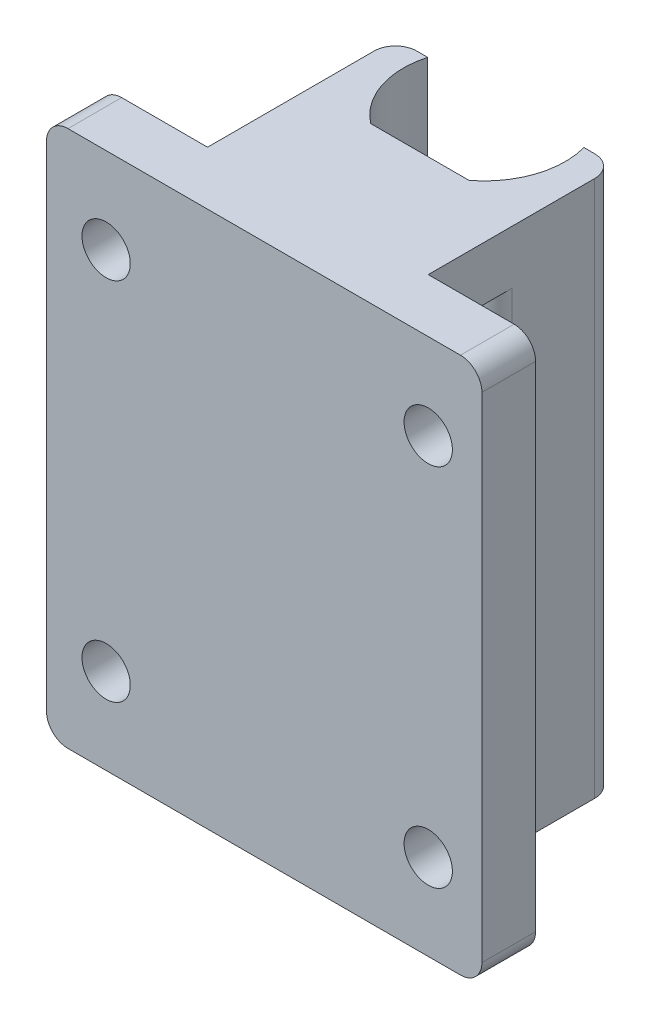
ISO-10303-21;
HEADER;
FILE_DESCRIPTION(('STEP AP214'),'2;1');
FILE_NAME('part.step','',(''),(''),'','','');
FILE_SCHEMA(('AUTOMOTIVE_DESIGN { 1 0 10303 214 1 1 1 1 }'));
ENDSEC;
DATA;
#1=APPLICATION_CONTEXT('core data for automotive mechanical design processes');
#2=APPLICATION_PROTOCOL_DEFINITION('international standard','automotive_design',2000,#1);
#3=PRODUCT_CONTEXT('',#1,'mechanical');
#4=PRODUCT('Part','Part','',(#3));
#5=PRODUCT_RELATED_PRODUCT_CATEGORY('part','',(#4));
#6=PRODUCT_DEFINITION_FORMATION('','',#4);
#7=PRODUCT_DEFINITION_CONTEXT('part definition',#1,'design');
#8=PRODUCT_DEFINITION('design','',#6,#7);
#9=PRODUCT_DEFINITION_SHAPE('','',#8);
#10=(LENGTH_UNIT() NAMED_UNIT(*) SI_UNIT(.MILLI.,.METRE.));
#11=(NAMED_UNIT(*) PLANE_ANGLE_UNIT() SI_UNIT($,.RADIAN.));
#12=(NAMED_UNIT(*) SI_UNIT($,.STERADIAN.) SOLID_ANGLE_UNIT());
#13=UNCERTAINTY_MEASURE_WITH_UNIT(LENGTH_MEASURE(1.E-05),#10,'distance_accuracy_value','');
#14=(GEOMETRIC_REPRESENTATION_CONTEXT(3) GLOBAL_UNCERTAINTY_ASSIGNED_CONTEXT((#13)) GLOBAL_UNIT_ASSIGNED_CONTEXT((#10,
#11,#12)) REPRESENTATION_CONTEXT('',''));
#15=CARTESIAN_POINT('',(0.,0.,0.));
#16=DIRECTION('',(0.,0.,1.));
#17=DIRECTION('',(1.,0.,0.));
#18=AXIS2_PLACEMENT_3D('',#15,#16,#17);
#19=CARTESIAN_POINT('',(15.,50.,-20.5));
#20=DIRECTION('',(0.,-1.,0.));
#21=DIRECTION('',(0.,0.,-1.));
#22=AXIS2_PLACEMENT_3D('',#19,#20,#21);
#23=CYLINDRICAL_SURFACE('',#22,7.54680019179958);
#24=DIRECTION('',(0.,-1.,0.));
#25=VECTOR('',#24,1.);
#26=CARTESIAN_POINT('',(10.422424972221,50.,-14.5));
#27=LINE('',#26,#25);
#28=CARTESIAN_POINT('',(10.422424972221,0.,-14.5));
#29=VERTEX_POINT('',#28);
#30=CARTESIAN_POINT('',(10.422424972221,2.5,-14.5));
#31=VERTEX_POINT('',#30);
#32=EDGE_CURVE('E336',#29,#31,#27,.F.);
#33=ORIENTED_EDGE('',*,*,#32,.F.);
#34=CARTESIAN_POINT('',(15.,0.,-20.5));
#35=DIRECTION('',(0.,-1.,0.));
#36=DIRECTION('',(0.,0.,-1.));
#37=AXIS2_PLACEMENT_3D('',#34,#35,#36);
#38=CIRCLE('',#37,7.54680019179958);
#39=CARTESIAN_POINT('',(7.72303681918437,0.,-22.5));
#40=VERTEX_POINT('',#39);
#41=EDGE_CURVE('E383',#29,#40,#38,.T.);
#42=ORIENTED_EDGE('',*,*,#41,.T.);
#43=DIRECTION('',(0.,-1.,0.));
#44=VECTOR('',#43,1.);
#45=CARTESIAN_POINT('',(7.72303681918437,50.,-22.5));
#46=LINE('',#45,#44);
#47=CARTESIAN_POINT('',(7.72303681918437,50.,-22.5));
#48=VERTEX_POINT('',#47);
#49=EDGE_CURVE('E398',#48,#40,#46,.T.);
#50=ORIENTED_EDGE('',*,*,#49,.F.);
#51=CARTESIAN_POINT('',(15.,50.,-20.5));
#52=DIRECTION('',(0.,-1.,0.));
#53=DIRECTION('',(0.,0.,-1.));
#54=AXIS2_PLACEMENT_3D('',#51,#52,#53);
#55=CIRCLE('',#54,7.54680019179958);
#56=CARTESIAN_POINT('',(10.422424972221,50.,-14.5));
#57=VERTEX_POINT('',#56);
#58=EDGE_CURVE('E361',#57,#48,#55,.T.);
#59=ORIENTED_EDGE('',*,*,#58,.F.);
#60=DIRECTION('',(0.,-1.,0.));
#61=VECTOR('',#60,1.);
#62=CARTESIAN_POINT('',(10.422424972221,50.,-14.5));
#63=LINE('',#62,#61);
#64=CARTESIAN_POINT('',(10.422424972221,47.5,-14.5));
#65=VERTEX_POINT('',#64);
#66=EDGE_CURVE('E343',#57,#65,#63,.T.);
#67=ORIENTED_EDGE('',*,*,#66,.T.);
#68=CARTESIAN_POINT('',(15.,47.5,-20.5));
#69=DIRECTION('',(0.,-1.,0.));
#70=DIRECTION('',(0.,0.,-1.));
#71=AXIS2_PLACEMENT_3D('',#68,#69,#70);
#72=CIRCLE('',#71,7.54680019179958);
#73=CARTESIAN_POINT('',(19.577575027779,47.5,-14.5));
#74=VERTEX_POINT('',#73);
#75=EDGE_CURVE('E416',#65,#74,#72,.F.);
#76=ORIENTED_EDGE('',*,*,#75,.T.);
#77=DIRECTION('',(0.,-1.,0.));
#78=VECTOR('',#77,1.);
#79=CARTESIAN_POINT('',(19.577575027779,50.,-14.5));
#80=LINE('',#79,#78);
#81=CARTESIAN_POINT('',(19.577575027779,50.,-14.5));
#82=VERTEX_POINT('',#81);
#83=EDGE_CURVE('E346',#74,#82,#80,.F.);
#84=ORIENTED_EDGE('',*,*,#83,.T.);
#85=CARTESIAN_POINT('',(22.2769631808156,50.,-22.5));
#86=VERTEX_POINT('',#85);
#87=EDGE_CURVE('E362',#86,#82,#55,.T.);
#88=ORIENTED_EDGE('',*,*,#87,.F.);
#89=DIRECTION('',(0.,-1.,0.));
#90=VECTOR('',#89,1.);
#91=CARTESIAN_POINT('',(22.2769631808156,50.,-22.5));
#92=LINE('',#91,#90);
#93=CARTESIAN_POINT('',(22.2769631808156,0.,-22.5));
#94=VERTEX_POINT('',#93);
#95=EDGE_CURVE('E401',#86,#94,#92,.T.);
#96=ORIENTED_EDGE('',*,*,#95,.T.);
#97=CARTESIAN_POINT('',(19.577575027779,0.,-14.5));
#98=VERTEX_POINT('',#97);
#99=EDGE_CURVE('E384',#94,#98,#38,.T.);
#100=ORIENTED_EDGE('',*,*,#99,.T.);
#101=DIRECTION('',(0.,-1.,0.));
#102=VECTOR('',#101,1.);
#103=CARTESIAN_POINT('',(19.577575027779,50.,-14.5));
#104=LINE('',#103,#102);
#105=CARTESIAN_POINT('',(19.577575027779,2.5,-14.5));
#106=VERTEX_POINT('',#105);
#107=EDGE_CURVE('E333',#106,#98,#104,.T.);
#108=ORIENTED_EDGE('',*,*,#107,.F.);
#109=CARTESIAN_POINT('',(15.,2.5,-20.5));
#110=DIRECTION('',(0.,1.,0.));
#111=DIRECTION('',(-1.,0.,0.));
#112=AXIS2_PLACEMENT_3D('',#109,#110,#111);
#113=CIRCLE('',#112,7.54680019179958);
#114=EDGE_CURVE('E419',#106,#31,#113,.F.);
#115=ORIENTED_EDGE('',*,*,#114,.T.);
#116=EDGE_LOOP('',(#33,#42,#50,#59,#67,#76,#84,#88,#96,#100,#108,#115));
#117=FACE_BOUND('',#116,.T.);
#118=ADVANCED_FACE('F33',(#117),#23,.F.);
#119=CARTESIAN_POINT('',(-5.27696318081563,50.,0.));
#120=DIRECTION('',(1.,0.,0.));
#121=DIRECTION('',(0.,0.,-1.));
#122=AXIS2_PLACEMENT_3D('',#119,#120,#121);
#123=PLANE('',#122);
#124=DIRECTION('',(0.,-1.,0.));
#125=VECTOR('',#124,1.);
#126=CARTESIAN_POINT('',(-5.27696318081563,50.,0.));
#127=LINE('',#126,#125);
#128=CARTESIAN_POINT('',(-5.27696318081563,48.,0.));
#129=VERTEX_POINT('',#128);
#130=CARTESIAN_POINT('',(-5.27696318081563,2.,0.));
#131=VERTEX_POINT('',#130);
#132=EDGE_CURVE('E413',#129,#131,#127,.T.);
#133=ORIENTED_EDGE('',*,*,#132,.F.);
#134=DIRECTION('',(0.,0.,1.));
#135=VECTOR('',#134,1.);
#136=CARTESIAN_POINT('',(-5.27696318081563,48.,0.));
#137=LINE('',#136,#135);
#138=CARTESIAN_POINT('',(-5.27696318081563,48.,-5.));
#139=VERTEX_POINT('',#138);
#140=EDGE_CURVE('E442',#129,#139,#137,.F.);
#141=ORIENTED_EDGE('',*,*,#140,.T.);
#142=DIRECTION('',(0.,-1.,0.));
#143=VECTOR('',#142,1.);
#144=CARTESIAN_POINT('',(-5.27696318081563,50.,-5.));
#145=LINE('',#144,#143);
#146=CARTESIAN_POINT('',(-5.27696318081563,2.,-5.));
#147=VERTEX_POINT('',#146);
#148=EDGE_CURVE('E373',#139,#147,#145,.T.);
#149=ORIENTED_EDGE('',*,*,#148,.T.);
#150=DIRECTION('',(0.,0.,1.));
#151=VECTOR('',#150,1.);
#152=CARTESIAN_POINT('',(-5.27696318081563,2.,0.));
#153=LINE('',#152,#151);
#154=EDGE_CURVE('E439',#147,#131,#153,.T.);
#155=ORIENTED_EDGE('',*,*,#154,.T.);
#156=EDGE_LOOP('',(#133,#141,#149,#155));
#157=FACE_BOUND('',#156,.T.);
#158=ADVANCED_FACE('F588',(#157),#123,.F.);
#159=CARTESIAN_POINT('',(-5.27696318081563,50.,0.));
#160=DIRECTION('',(0.,0.,-1.));
#161=DIRECTION('',(-1.,0.,0.));
#162=AXIS2_PLACEMENT_3D('',#159,#160,#161);
#163=PLANE('',#162);
#164=CARTESIAN_POINT('',(30.2769631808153,8.,0.));
#165=DIRECTION('',(0.,0.,-1.));
#166=DIRECTION('',(-1.,0.,0.));
#167=AXIS2_PLACEMENT_3D('',#164,#165,#166);
#168=CIRCLE('',#167,2.25);
#169=CARTESIAN_POINT('',(28.0269631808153,8.,0.));
#170=VERTEX_POINT('',#169);
#171=EDGE_CURVE('E304',#170,#170,#168,.T.);
#172=ORIENTED_EDGE('',*,*,#171,.T.);
#173=EDGE_LOOP('',(#172));
#174=FACE_BOUND('',#173,.T.);
#175=CARTESIAN_POINT('',(0.276963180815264,8.,0.));
#176=DIRECTION('',(0.,0.,-1.));
#177=DIRECTION('',(-1.,0.,0.));
#178=AXIS2_PLACEMENT_3D('',#175,#176,#177);
#179=CIRCLE('',#178,2.25);
#180=CARTESIAN_POINT('',(-1.97303681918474,8.,0.));
#181=VERTEX_POINT('',#180);
#182=EDGE_CURVE('E310',#181,#181,#179,.T.);
#183=ORIENTED_EDGE('',*,*,#182,.T.);
#184=EDGE_LOOP('',(#183));
#185=FACE_BOUND('',#184,.T.);
#186=CARTESIAN_POINT('',(0.276963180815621,42.,0.));
#187=DIRECTION('',(0.,0.,-1.));
#188=DIRECTION('',(-1.,0.,0.));
#189=AXIS2_PLACEMENT_3D('',#186,#187,#188);
#190=CIRCLE('',#189,2.25);
#191=CARTESIAN_POINT('',(-1.97303681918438,42.,0.));
#192=VERTEX_POINT('',#191);
#193=EDGE_CURVE('E316',#192,#192,#190,.T.);
#194=ORIENTED_EDGE('',*,*,#193,.T.);
#195=EDGE_LOOP('',(#194));
#196=FACE_BOUND('',#195,.T.);
#197=CARTESIAN_POINT('',(30.2769631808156,42.,0.));
#198=DIRECTION('',(0.,0.,-1.));
#199=DIRECTION('',(-1.,0.,0.));
#200=AXIS2_PLACEMENT_3D('',#197,#198,#199);
#201=CIRCLE('',#200,2.25);
#202=CARTESIAN_POINT('',(28.0269631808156,42.,0.));
#203=VERTEX_POINT('',#202);
#204=EDGE_CURVE('E322',#203,#203,#201,.T.);
#205=ORIENTED_EDGE('',*,*,#204,.T.);
#206=EDGE_LOOP('',(#205));
#207=FACE_BOUND('',#206,.T.);
#208=DIRECTION('',(1.,0.,0.));
#209=VECTOR('',#208,1.);
#210=CARTESIAN_POINT('',(-5.27696318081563,50.,0.));
#211=LINE('',#210,#209);
#212=CARTESIAN_POINT('',(-3.27696318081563,50.,0.));
#213=VERTEX_POINT('',#212);
#214=CARTESIAN_POINT('',(33.2769631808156,50.,0.));
#215=VERTEX_POINT('',#214);
#216=EDGE_CURVE('E350',#213,#215,#211,.T.);
#217=ORIENTED_EDGE('',*,*,#216,.F.);
#218=CARTESIAN_POINT('',(-3.27696318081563,48.,0.));
#219=DIRECTION('',(0.,0.,-1.));
#220=DIRECTION('',(-1.,0.,0.));
#221=AXIS2_PLACEMENT_3D('',#218,#219,#220);
#222=CIRCLE('',#221,2.);
#223=EDGE_CURVE('E437',#213,#129,#222,.F.);
#224=ORIENTED_EDGE('',*,*,#223,.T.);
#225=ORIENTED_EDGE('',*,*,#132,.T.);
#226=CARTESIAN_POINT('',(-3.27696318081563,2.,0.));
#227=DIRECTION('',(0.,0.,-1.));
#228=DIRECTION('',(-1.,0.,0.));
#229=AXIS2_PLACEMENT_3D('',#226,#227,#228);
#230=CIRCLE('',#229,2.);
#231=CARTESIAN_POINT('',(-3.27696318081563,0.,0.));
#232=VERTEX_POINT('',#231);
#233=EDGE_CURVE('E435',#131,#232,#230,.F.);
#234=ORIENTED_EDGE('',*,*,#233,.T.);
#235=DIRECTION('',(1.,0.,0.));
#236=VECTOR('',#235,1.);
#237=CARTESIAN_POINT('',(-5.27696318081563,0.,0.));
#238=LINE('',#237,#236);
#239=CARTESIAN_POINT('',(33.2769631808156,0.,0.));
#240=VERTEX_POINT('',#239);
#241=EDGE_CURVE('E349',#232,#240,#238,.T.);
#242=ORIENTED_EDGE('',*,*,#241,.T.);
#243=CARTESIAN_POINT('',(33.2769631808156,2.,0.));
#244=DIRECTION('',(0.,0.,-1.));
#245=DIRECTION('',(-1.,0.,0.));
#246=AXIS2_PLACEMENT_3D('',#243,#244,#245);
#247=CIRCLE('',#246,2.);
#248=CARTESIAN_POINT('',(35.2769631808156,2.,0.));
#249=VERTEX_POINT('',#248);
#250=EDGE_CURVE('E431',#240,#249,#247,.F.);
#251=ORIENTED_EDGE('',*,*,#250,.T.);
#252=DIRECTION('',(0.,-1.,0.));
#253=VECTOR('',#252,1.);
#254=CARTESIAN_POINT('',(35.2769631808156,50.,0.));
#255=LINE('',#254,#253);
#256=CARTESIAN_POINT('',(35.2769631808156,48.,0.));
#257=VERTEX_POINT('',#256);
#258=EDGE_CURVE('E410',#257,#249,#255,.T.);
#259=ORIENTED_EDGE('',*,*,#258,.F.);
#260=CARTESIAN_POINT('',(33.2769631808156,48.,0.));
#261=DIRECTION('',(0.,0.,-1.));
#262=DIRECTION('',(-1.,0.,0.));
#263=AXIS2_PLACEMENT_3D('',#260,#261,#262);
#264=CIRCLE('',#263,2.);
#265=EDGE_CURVE('E433',#257,#215,#264,.F.);
#266=ORIENTED_EDGE('',*,*,#265,.T.);
#267=EDGE_LOOP('',(#217,#224,#225,#234,#242,#251,#259,#266));
#268=FACE_BOUND('',#267,.T.);
#269=ADVANCED_FACE('F592',(#174,#185,#196,#207,#268),#163,.F.);
#270=CARTESIAN_POINT('',(35.2769631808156,50.,0.));
#271=DIRECTION('',(-1.,0.,0.));
#272=DIRECTION('',(0.,0.,1.));
#273=AXIS2_PLACEMENT_3D('',#270,#271,#272);
#274=PLANE('',#273);
#275=DIRECTION('',(0.,-1.,0.));
#276=VECTOR('',#275,1.);
#277=CARTESIAN_POINT('',(35.2769631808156,50.,-5.00000000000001));
#278=LINE('',#277,#276);
#279=CARTESIAN_POINT('',(35.2769631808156,48.,-5.00000000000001));
#280=VERTEX_POINT('',#279);
#281=CARTESIAN_POINT('',(35.2769631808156,2.,-5.00000000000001));
#282=VERTEX_POINT('',#281);
#283=EDGE_CURVE('E407',#280,#282,#278,.T.);
#284=ORIENTED_EDGE('',*,*,#283,.F.);
#285=DIRECTION('',(0.,0.,-1.));
#286=VECTOR('',#285,1.);
#287=CARTESIAN_POINT('',(35.2769631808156,48.,0.));
#288=LINE('',#287,#286);
#289=EDGE_CURVE('E463',#280,#257,#288,.F.);
#290=ORIENTED_EDGE('',*,*,#289,.T.);
#291=ORIENTED_EDGE('',*,*,#258,.T.);
#292=DIRECTION('',(0.,0.,-1.));
#293=VECTOR('',#292,1.);
#294=CARTESIAN_POINT('',(35.2769631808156,2.,-5.00000000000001));
#295=LINE('',#294,#293);
#296=EDGE_CURVE('E460',#249,#282,#295,.T.);
#297=ORIENTED_EDGE('',*,*,#296,.T.);
#298=EDGE_LOOP('',(#284,#290,#291,#297));
#299=FACE_BOUND('',#298,.T.);
#300=ADVANCED_FACE('F606',(#299),#274,.F.);
#301=CARTESIAN_POINT('',(25.2769631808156,50.,-5.));
#302=DIRECTION('',(0.,0.,1.));
#303=DIRECTION('',(1.,0.,0.));
#304=AXIS2_PLACEMENT_3D('',#301,#302,#303);
#305=PLANE('',#304);
#306=CARTESIAN_POINT('',(30.2769631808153,8.,-5.00000000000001));
#307=DIRECTION('',(0.,0.,-1.));
#308=DIRECTION('',(-1.,0.,0.));
#309=AXIS2_PLACEMENT_3D('',#306,#307,#308);
#310=CIRCLE('',#309,2.25);
#311=CARTESIAN_POINT('',(28.0269631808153,8.,-5.));
#312=VERTEX_POINT('',#311);
#313=EDGE_CURVE('E303',#312,#312,#310,.T.);
#314=ORIENTED_EDGE('',*,*,#313,.F.);
#315=EDGE_LOOP('',(#314));
#316=FACE_BOUND('',#315,.T.);
#317=CARTESIAN_POINT('',(30.2769631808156,42.,-5.00000000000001));
#318=DIRECTION('',(0.,0.,-1.));
#319=DIRECTION('',(-1.,0.,0.));
#320=AXIS2_PLACEMENT_3D('',#317,#318,#319);
#321=CIRCLE('',#320,2.25);
#322=CARTESIAN_POINT('',(28.0269631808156,42.,-5.));
#323=VERTEX_POINT('',#322);
#324=EDGE_CURVE('E319',#323,#323,#321,.T.);
#325=ORIENTED_EDGE('',*,*,#324,.F.);
#326=EDGE_LOOP('',(#325));
#327=FACE_BOUND('',#326,.T.);
#328=DIRECTION('',(-1.,0.,0.));
#329=VECTOR('',#328,1.);
#330=CARTESIAN_POINT('',(25.2769631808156,50.,-5.));
#331=LINE('',#330,#329);
#332=CARTESIAN_POINT('',(33.2769631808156,50.,-5.00000000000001));
#333=VERTEX_POINT('',#332);
#334=CARTESIAN_POINT('',(25.2769631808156,50.,-5.));
#335=VERTEX_POINT('',#334);
#336=EDGE_CURVE('E353',#333,#335,#331,.T.);
#337=ORIENTED_EDGE('',*,*,#336,.F.);
#338=CARTESIAN_POINT('',(33.2769631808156,48.,-5.00000000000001));
#339=DIRECTION('',(0.,0.,1.));
#340=DIRECTION('',(1.,0.,0.));
#341=AXIS2_PLACEMENT_3D('',#338,#339,#340);
#342=CIRCLE('',#341,2.);
#343=EDGE_CURVE('E458',#333,#280,#342,.F.);
#344=ORIENTED_EDGE('',*,*,#343,.T.);
#345=ORIENTED_EDGE('',*,*,#283,.T.);
#346=CARTESIAN_POINT('',(33.2769631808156,2.,-5.00000000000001));
#347=DIRECTION('',(0.,0.,1.));
#348=DIRECTION('',(1.,0.,0.));
#349=AXIS2_PLACEMENT_3D('',#346,#347,#348);
#350=CIRCLE('',#349,2.);
#351=CARTESIAN_POINT('',(33.2769631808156,0.,-5.00000000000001));
#352=VERTEX_POINT('',#351);
#353=EDGE_CURVE('E456',#282,#352,#350,.F.);
#354=ORIENTED_EDGE('',*,*,#353,.T.);
#355=DIRECTION('',(-1.,0.,0.));
#356=VECTOR('',#355,1.);
#357=CARTESIAN_POINT('',(25.2769631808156,0.,-5.));
#358=LINE('',#357,#356);
#359=CARTESIAN_POINT('',(25.2769631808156,0.,-5.));
#360=VERTEX_POINT('',#359);
#361=EDGE_CURVE('E376',#352,#360,#358,.T.);
#362=ORIENTED_EDGE('',*,*,#361,.T.);
#363=DIRECTION('',(0.,-1.,0.));
#364=VECTOR('',#363,1.);
#365=CARTESIAN_POINT('',(25.2769631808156,50.,-5.));
#366=LINE('',#365,#364);
#367=EDGE_CURVE('E404',#335,#360,#366,.T.);
#368=ORIENTED_EDGE('',*,*,#367,.F.);
#369=EDGE_LOOP('',(#337,#344,#345,#354,#362,#368));
#370=FACE_BOUND('',#369,.T.);
#371=ADVANCED_FACE('F536',(#316,#327,#370),#305,.F.);
#372=CARTESIAN_POINT('',(25.2769631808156,50.,-22.5));
#373=DIRECTION('',(-1.,0.,0.));
#374=DIRECTION('',(0.,0.,1.));
#375=AXIS2_PLACEMENT_3D('',#372,#373,#374);
#376=PLANE('',#375);
#377=DIRECTION('',(0.,-1.,0.));
#378=VECTOR('',#377,1.);
#379=CARTESIAN_POINT('',(25.2769631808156,50.,-12.8026940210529));
#380=LINE('',#379,#378);
#381=CARTESIAN_POINT('',(25.2769631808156,10.,-12.8026940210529));
#382=VERTEX_POINT('',#381);
#383=CARTESIAN_POINT('',(25.2769631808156,5.,-12.8026940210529));
#384=VERTEX_POINT('',#383);
#385=EDGE_CURVE('E493',#382,#384,#380,.T.);
#386=ORIENTED_EDGE('',*,*,#385,.T.);
#387=DIRECTION('',(0.,0.,1.));
#388=VECTOR('',#387,1.);
#389=CARTESIAN_POINT('',(25.2769631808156,5.,-22.5));
#390=LINE('',#389,#388);
#391=CARTESIAN_POINT('',(25.2769631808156,5.,-8.80269402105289));
#392=VERTEX_POINT('',#391);
#393=EDGE_CURVE('E48',#384,#392,#390,.T.);
#394=ORIENTED_EDGE('',*,*,#393,.T.);
#395=DIRECTION('',(0.,1.,0.));
#396=VECTOR('',#395,1.);
#397=CARTESIAN_POINT('',(25.2769631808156,50.,-8.80269402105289));
#398=LINE('',#397,#396);
#399=CARTESIAN_POINT('',(25.2769631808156,10.,-8.80269402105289));
#400=VERTEX_POINT('',#399);
#401=EDGE_CURVE('E250',#392,#400,#398,.T.);
#402=ORIENTED_EDGE('',*,*,#401,.T.);
#403=DIRECTION('',(0.,0.,-1.));
#404=VECTOR('',#403,1.);
#405=CARTESIAN_POINT('',(25.2769631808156,10.,-22.5));
#406=LINE('',#405,#404);
#407=EDGE_CURVE('E56',#400,#382,#406,.T.);
#408=ORIENTED_EDGE('',*,*,#407,.T.);
#409=EDGE_LOOP('',(#386,#394,#402,#408));
#410=FACE_BOUND('',#409,.T.);
#411=DIRECTION('',(0.,-1.,0.));
#412=VECTOR('',#411,1.);
#413=CARTESIAN_POINT('',(25.2769631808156,50.,-12.8026940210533));
#414=LINE('',#413,#412);
#415=CARTESIAN_POINT('',(25.2769631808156,45.,-12.8026940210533));
#416=VERTEX_POINT('',#415);
#417=CARTESIAN_POINT('',(25.2769631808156,40.,-12.8026940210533));
#418=VERTEX_POINT('',#417);
#419=EDGE_CURVE('E490',#416,#418,#414,.T.);
#420=ORIENTED_EDGE('',*,*,#419,.T.);
#421=DIRECTION('',(0.,0.,1.));
#422=VECTOR('',#421,1.);
#423=CARTESIAN_POINT('',(25.2769631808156,40.,-22.5));
#424=LINE('',#423,#422);
#425=CARTESIAN_POINT('',(25.2769631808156,40.,-8.80269402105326));
#426=VERTEX_POINT('',#425);
#427=EDGE_CURVE('E289',#418,#426,#424,.T.);
#428=ORIENTED_EDGE('',*,*,#427,.T.);
#429=DIRECTION('',(0.,1.,0.));
#430=VECTOR('',#429,1.);
#431=CARTESIAN_POINT('',(25.2769631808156,50.,-8.80269402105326));
#432=LINE('',#431,#430);
#433=CARTESIAN_POINT('',(25.2769631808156,45.,-8.80269402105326));
#434=VERTEX_POINT('',#433);
#435=EDGE_CURVE('E298',#426,#434,#432,.T.);
#436=ORIENTED_EDGE('',*,*,#435,.T.);
#437=DIRECTION('',(0.,0.,-1.));
#438=VECTOR('',#437,1.);
#439=CARTESIAN_POINT('',(25.2769631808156,45.,-22.5));
#440=LINE('',#439,#438);
#441=EDGE_CURVE('E301',#434,#416,#440,.T.);
#442=ORIENTED_EDGE('',*,*,#441,.T.);
#443=EDGE_LOOP('',(#420,#428,#436,#442));
#444=FACE_BOUND('',#443,.T.);
#445=DIRECTION('',(0.,0.,-1.));
#446=VECTOR('',#445,1.);
#447=CARTESIAN_POINT('',(25.2769631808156,0.,-22.5));
#448=LINE('',#447,#446);
#449=CARTESIAN_POINT('',(25.2769631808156,0.,-20.5));
#450=VERTEX_POINT('',#449);
#451=EDGE_CURVE('E378',#360,#450,#448,.T.);
#452=ORIENTED_EDGE('',*,*,#451,.T.);
#453=DIRECTION('',(0.,-1.,0.));
#454=VECTOR('',#453,1.);
#455=CARTESIAN_POINT('',(25.2769631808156,50.,-20.5));
#456=LINE('',#455,#454);
#457=CARTESIAN_POINT('',(25.2769631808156,50.,-20.5));
#458=VERTEX_POINT('',#457);
#459=EDGE_CURVE('E473',#450,#458,#456,.F.);
#460=ORIENTED_EDGE('',*,*,#459,.T.);
#461=DIRECTION('',(0.,0.,-1.));
#462=VECTOR('',#461,1.);
#463=CARTESIAN_POINT('',(25.2769631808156,50.,-22.5));
#464=LINE('',#463,#462);
#465=EDGE_CURVE('E356',#335,#458,#464,.T.);
#466=ORIENTED_EDGE('',*,*,#465,.F.);
#467=ORIENTED_EDGE('',*,*,#367,.T.);
#468=EDGE_LOOP('',(#452,#460,#466,#467));
#469=FACE_BOUND('',#468,.T.);
#470=ADVANCED_FACE('F532',(#410,#444,#469),#376,.F.);
#471=CARTESIAN_POINT('',(22.2769631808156,50.,-22.5));
#472=DIRECTION('',(0.,0.,1.));
#473=DIRECTION('',(1.,0.,0.));
#474=AXIS2_PLACEMENT_3D('',#471,#472,#473);
#475=PLANE('',#474);
#476=DIRECTION('',(-1.,0.,0.));
#477=VECTOR('',#476,1.);
#478=CARTESIAN_POINT('',(22.2769631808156,50.,-22.5));
#479=LINE('',#478,#477);
#480=CARTESIAN_POINT('',(23.2769631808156,50.,-22.5));
#481=VERTEX_POINT('',#480);
#482=EDGE_CURVE('E359',#481,#86,#479,.T.);
#483=ORIENTED_EDGE('',*,*,#482,.F.);
#484=DIRECTION('',(0.,-1.,0.));
#485=VECTOR('',#484,1.);
#486=CARTESIAN_POINT('',(23.2769631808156,50.,-22.5));
#487=LINE('',#486,#485);
#488=CARTESIAN_POINT('',(23.2769631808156,0.,-22.5));
#489=VERTEX_POINT('',#488);
#490=EDGE_CURVE('E470',#481,#489,#487,.T.);
#491=ORIENTED_EDGE('',*,*,#490,.T.);
#492=DIRECTION('',(-1.,0.,0.));
#493=VECTOR('',#492,1.);
#494=CARTESIAN_POINT('',(22.2769631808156,0.,-22.5));
#495=LINE('',#494,#493);
#496=EDGE_CURVE('E381',#489,#94,#495,.T.);
#497=ORIENTED_EDGE('',*,*,#496,.T.);
#498=ORIENTED_EDGE('',*,*,#95,.F.);
#499=EDGE_LOOP('',(#483,#491,#497,#498));
#500=FACE_BOUND('',#499,.T.);
#501=ADVANCED_FACE('F535',(#500),#475,.F.);
#502=CARTESIAN_POINT('',(7.72303681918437,50.,-22.5));
#503=DIRECTION('',(0.,0.,1.));
#504=DIRECTION('',(1.,0.,0.));
#505=AXIS2_PLACEMENT_3D('',#502,#503,#504);
#506=PLANE('',#505);
#507=DIRECTION('',(-1.,0.,0.));
#508=VECTOR('',#507,1.);
#509=CARTESIAN_POINT('',(7.72303681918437,0.,-22.5));
#510=LINE('',#509,#508);
#511=CARTESIAN_POINT('',(6.72303681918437,0.,-22.5));
#512=VERTEX_POINT('',#511);
#513=EDGE_CURVE('E386',#40,#512,#510,.T.);
#514=ORIENTED_EDGE('',*,*,#513,.T.);
#515=DIRECTION('',(0.,-1.,0.));
#516=VECTOR('',#515,1.);
#517=CARTESIAN_POINT('',(6.72303681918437,50.,-22.5));
#518=LINE('',#517,#516);
#519=CARTESIAN_POINT('',(6.72303681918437,50.,-22.5));
#520=VERTEX_POINT('',#519);
#521=EDGE_CURVE('E468',#512,#520,#518,.F.);
#522=ORIENTED_EDGE('',*,*,#521,.T.);
#523=DIRECTION('',(-1.,0.,0.));
#524=VECTOR('',#523,1.);
#525=CARTESIAN_POINT('',(7.72303681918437,50.,-22.5));
#526=LINE('',#525,#524);
#527=EDGE_CURVE('E365',#48,#520,#526,.T.);
#528=ORIENTED_EDGE('',*,*,#527,.F.);
#529=ORIENTED_EDGE('',*,*,#49,.T.);
#530=EDGE_LOOP('',(#514,#522,#528,#529));
#531=FACE_BOUND('',#530,.T.);
#532=ADVANCED_FACE('F565',(#531),#506,.F.);
#533=CARTESIAN_POINT('',(4.72303681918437,50.,-22.5));
#534=DIRECTION('',(1.,0.,0.));
#535=DIRECTION('',(0.,0.,-1.));
#536=AXIS2_PLACEMENT_3D('',#533,#534,#535);
#537=PLANE('',#536);
#538=DIRECTION('',(0.,0.,1.));
#539=VECTOR('',#538,1.);
#540=CARTESIAN_POINT('',(4.72303681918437,5.,-10.8026940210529));
#541=LINE('',#540,#539);
#542=CARTESIAN_POINT('',(4.72303681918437,5.,-12.8026940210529));
#543=VERTEX_POINT('',#542);
#544=CARTESIAN_POINT('',(4.72303681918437,5.,-8.80269402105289));
#545=VERTEX_POINT('',#544);
#546=EDGE_CURVE('E255',#543,#545,#541,.T.);
#547=ORIENTED_EDGE('',*,*,#546,.F.);
#548=DIRECTION('',(0.,-1.,0.));
#549=VECTOR('',#548,1.);
#550=CARTESIAN_POINT('',(4.72303681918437,50.,-12.8026940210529));
#551=LINE('',#550,#549);
#552=CARTESIAN_POINT('',(4.72303681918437,10.,-12.8026940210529));
#553=VERTEX_POINT('',#552);
#554=EDGE_CURVE('E480',#543,#553,#551,.F.);
#555=ORIENTED_EDGE('',*,*,#554,.T.);
#556=DIRECTION('',(0.,0.,-1.));
#557=VECTOR('',#556,1.);
#558=CARTESIAN_POINT('',(4.72303681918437,10.,-10.8026940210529));
#559=LINE('',#558,#557);
#560=CARTESIAN_POINT('',(4.72303681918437,10.,-8.80269402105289));
#561=VERTEX_POINT('',#560);
#562=EDGE_CURVE('E265',#561,#553,#559,.T.);
#563=ORIENTED_EDGE('',*,*,#562,.F.);
#564=DIRECTION('',(0.,1.,0.));
#565=VECTOR('',#564,1.);
#566=CARTESIAN_POINT('',(4.72303681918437,10.,-8.80269402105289));
#567=LINE('',#566,#565);
#568=EDGE_CURVE('E248',#545,#561,#567,.T.);
#569=ORIENTED_EDGE('',*,*,#568,.F.);
#570=EDGE_LOOP('',(#547,#555,#563,#569));
#571=FACE_BOUND('',#570,.T.);
#572=DIRECTION('',(0.,0.,1.));
#573=VECTOR('',#572,1.);
#574=CARTESIAN_POINT('',(4.72303681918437,40.,-10.8026940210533));
#575=LINE('',#574,#573);
#576=CARTESIAN_POINT('',(4.72303681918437,40.,-12.8026940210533));
#577=VERTEX_POINT('',#576);
#578=CARTESIAN_POINT('',(4.72303681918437,40.,-8.80269402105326));
#579=VERTEX_POINT('',#578);
#580=EDGE_CURVE('E277',#577,#579,#575,.T.);
#581=ORIENTED_EDGE('',*,*,#580,.F.);
#582=DIRECTION('',(0.,-1.,0.));
#583=VECTOR('',#582,1.);
#584=CARTESIAN_POINT('',(4.72303681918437,50.,-12.8026940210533));
#585=LINE('',#584,#583);
#586=CARTESIAN_POINT('',(4.72303681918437,45.,-12.8026940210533));
#587=VERTEX_POINT('',#586);
#588=EDGE_CURVE('E482',#577,#587,#585,.F.);
#589=ORIENTED_EDGE('',*,*,#588,.T.);
#590=DIRECTION('',(0.,0.,-1.));
#591=VECTOR('',#590,1.);
#592=CARTESIAN_POINT('',(4.72303681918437,45.,-10.8026940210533));
#593=LINE('',#592,#591);
#594=CARTESIAN_POINT('',(4.72303681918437,45.,-8.80269402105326));
#595=VERTEX_POINT('',#594);
#596=EDGE_CURVE('E283',#595,#587,#593,.T.);
#597=ORIENTED_EDGE('',*,*,#596,.F.);
#598=DIRECTION('',(0.,1.,0.));
#599=VECTOR('',#598,1.);
#600=CARTESIAN_POINT('',(4.72303681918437,45.,-8.80269402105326));
#601=LINE('',#600,#599);
#602=EDGE_CURVE('E280',#579,#595,#601,.T.);
#603=ORIENTED_EDGE('',*,*,#602,.F.);
#604=EDGE_LOOP('',(#581,#589,#597,#603));
#605=FACE_BOUND('',#604,.T.);
#606=DIRECTION('',(0.,0.,1.));
#607=VECTOR('',#606,1.);
#608=CARTESIAN_POINT('',(4.72303681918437,50.,-22.5));
#609=LINE('',#608,#607);
#610=CARTESIAN_POINT('',(4.72303681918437,50.,-20.5));
#611=VERTEX_POINT('',#610);
#612=CARTESIAN_POINT('',(4.72303681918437,50.,-5.));
#613=VERTEX_POINT('',#612);
#614=EDGE_CURVE('E368',#611,#613,#609,.T.);
#615=ORIENTED_EDGE('',*,*,#614,.F.);
#616=DIRECTION('',(0.,-1.,0.));
#617=VECTOR('',#616,1.);
#618=CARTESIAN_POINT('',(4.72303681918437,50.,-20.5));
#619=LINE('',#618,#617);
#620=CARTESIAN_POINT('',(4.72303681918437,0.,-20.5));
#621=VERTEX_POINT('',#620);
#622=EDGE_CURVE('E465',#611,#621,#619,.T.);
#623=ORIENTED_EDGE('',*,*,#622,.T.);
#624=DIRECTION('',(0.,0.,1.));
#625=VECTOR('',#624,1.);
#626=CARTESIAN_POINT('',(4.72303681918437,0.,-22.5));
#627=LINE('',#626,#625);
#628=CARTESIAN_POINT('',(4.72303681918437,0.,-5.));
#629=VERTEX_POINT('',#628);
#630=EDGE_CURVE('E389',#621,#629,#627,.T.);
#631=ORIENTED_EDGE('',*,*,#630,.T.);
#632=DIRECTION('',(0.,-1.,0.));
#633=VECTOR('',#632,1.);
#634=CARTESIAN_POINT('',(4.72303681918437,50.,-5.));
#635=LINE('',#634,#633);
#636=EDGE_CURVE('E395',#613,#629,#635,.T.);
#637=ORIENTED_EDGE('',*,*,#636,.F.);
#638=EDGE_LOOP('',(#615,#623,#631,#637));
#639=FACE_BOUND('',#638,.T.);
#640=ADVANCED_FACE('F263',(#571,#605,#639),#537,.F.);
#641=CARTESIAN_POINT('',(4.72303681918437,50.,-5.));
#642=DIRECTION('',(0.,0.,1.));
#643=DIRECTION('',(1.,0.,0.));
#644=AXIS2_PLACEMENT_3D('',#641,#642,#643);
#645=PLANE('',#644);
#646=CARTESIAN_POINT('',(0.276963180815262,8.,-4.99999999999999));
#647=DIRECTION('',(0.,0.,-1.));
#648=DIRECTION('',(-1.,0.,0.));
#649=AXIS2_PLACEMENT_3D('',#646,#647,#648);
#650=CIRCLE('',#649,2.25);
#651=CARTESIAN_POINT('',(-1.97303681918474,8.,-4.99999999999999));
#652=VERTEX_POINT('',#651);
#653=EDGE_CURVE('E307',#652,#652,#650,.T.);
#654=ORIENTED_EDGE('',*,*,#653,.F.);
#655=EDGE_LOOP('',(#654));
#656=FACE_BOUND('',#655,.T.);
#657=CARTESIAN_POINT('',(0.276963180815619,42.,-4.99999999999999));
#658=DIRECTION('',(0.,0.,-1.));
#659=DIRECTION('',(-1.,0.,0.));
#660=AXIS2_PLACEMENT_3D('',#657,#658,#659);
#661=CIRCLE('',#660,2.25);
#662=CARTESIAN_POINT('',(-1.97303681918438,42.,-4.99999999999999));
#663=VERTEX_POINT('',#662);
#664=EDGE_CURVE('E313',#663,#663,#661,.T.);
#665=ORIENTED_EDGE('',*,*,#664,.F.);
#666=EDGE_LOOP('',(#665));
#667=FACE_BOUND('',#666,.T.);
#668=ORIENTED_EDGE('',*,*,#148,.F.);
#669=CARTESIAN_POINT('',(-3.27696318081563,48.,-5.));
#670=DIRECTION('',(0.,0.,1.));
#671=DIRECTION('',(1.,0.,0.));
#672=AXIS2_PLACEMENT_3D('',#669,#670,#671);
#673=CIRCLE('',#672,2.);
#674=CARTESIAN_POINT('',(-3.27696318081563,50.,-5.));
#675=VERTEX_POINT('',#674);
#676=EDGE_CURVE('E446',#139,#675,#673,.F.);
#677=ORIENTED_EDGE('',*,*,#676,.T.);
#678=DIRECTION('',(-1.,0.,0.));
#679=VECTOR('',#678,1.);
#680=CARTESIAN_POINT('',(4.72303681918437,50.,-5.));
#681=LINE('',#680,#679);
#682=EDGE_CURVE('E370',#613,#675,#681,.T.);
#683=ORIENTED_EDGE('',*,*,#682,.F.);
#684=ORIENTED_EDGE('',*,*,#636,.T.);
#685=DIRECTION('',(-1.,0.,0.));
#686=VECTOR('',#685,1.);
#687=CARTESIAN_POINT('',(4.72303681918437,0.,-5.));
#688=LINE('',#687,#686);
#689=CARTESIAN_POINT('',(-3.27696318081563,0.,-5.));
#690=VERTEX_POINT('',#689);
#691=EDGE_CURVE('E354',#629,#690,#688,.T.);
#692=ORIENTED_EDGE('',*,*,#691,.T.);
#693=CARTESIAN_POINT('',(-3.27696318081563,2.,-5.));
#694=DIRECTION('',(0.,0.,1.));
#695=DIRECTION('',(1.,0.,0.));
#696=AXIS2_PLACEMENT_3D('',#693,#694,#695);
#697=CIRCLE('',#696,2.);
#698=EDGE_CURVE('E444',#690,#147,#697,.F.);
#699=ORIENTED_EDGE('',*,*,#698,.T.);
#700=EDGE_LOOP('',(#668,#677,#683,#684,#692,#699));
#701=FACE_BOUND('',#700,.T.);
#702=ADVANCED_FACE('F581',(#656,#667,#701),#645,.F.);
#703=CARTESIAN_POINT('',(15.,50.,-20.5));
#704=DIRECTION('',(0.,-1.,0.));
#705=DIRECTION('',(0.,0.,-1.));
#706=AXIS2_PLACEMENT_3D('',#703,#704,#705);
#707=PLANE('',#706);
#708=ORIENTED_EDGE('',*,*,#682,.T.);
#709=DIRECTION('',(0.,0.,1.));
#710=VECTOR('',#709,1.);
#711=CARTESIAN_POINT('',(-3.27696318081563,50.,-20.5));
#712=LINE('',#711,#710);
#713=EDGE_CURVE('E428',#675,#213,#712,.T.);
#714=ORIENTED_EDGE('',*,*,#713,.T.);
#715=ORIENTED_EDGE('',*,*,#216,.T.);
#716=DIRECTION('',(0.,0.,-1.));
#717=VECTOR('',#716,1.);
#718=CARTESIAN_POINT('',(33.2769631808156,50.,-20.5));
#719=LINE('',#718,#717);
#720=EDGE_CURVE('E425',#215,#333,#719,.T.);
#721=ORIENTED_EDGE('',*,*,#720,.T.);
#722=ORIENTED_EDGE('',*,*,#336,.T.);
#723=ORIENTED_EDGE('',*,*,#465,.T.);
#724=CARTESIAN_POINT('',(23.2769631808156,50.,-20.5));
#725=DIRECTION('',(0.,-1.,0.));
#726=DIRECTION('',(0.,0.,-1.));
#727=AXIS2_PLACEMENT_3D('',#724,#725,#726);
#728=CIRCLE('',#727,2.);
#729=EDGE_CURVE('E421',#458,#481,#728,.F.);
#730=ORIENTED_EDGE('',*,*,#729,.T.);
#731=ORIENTED_EDGE('',*,*,#482,.T.);
#732=ORIENTED_EDGE('',*,*,#87,.T.);
#733=DIRECTION('',(1.,0.,0.));
#734=VECTOR('',#733,1.);
#735=CARTESIAN_POINT('',(22.2769631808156,50.,-14.5));
#736=LINE('',#735,#734);
#737=EDGE_CURVE('E341',#57,#82,#736,.T.);
#738=ORIENTED_EDGE('',*,*,#737,.F.);
#739=ORIENTED_EDGE('',*,*,#58,.T.);
#740=ORIENTED_EDGE('',*,*,#527,.T.);
#741=CARTESIAN_POINT('',(6.72303681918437,50.,-20.5));
#742=DIRECTION('',(0.,-1.,0.));
#743=DIRECTION('',(0.,0.,-1.));
#744=AXIS2_PLACEMENT_3D('',#741,#742,#743);
#745=CIRCLE('',#744,2.);
#746=EDGE_CURVE('E423',#520,#611,#745,.F.);
#747=ORIENTED_EDGE('',*,*,#746,.T.);
#748=ORIENTED_EDGE('',*,*,#614,.T.);
#749=EDGE_LOOP('',(#708,#714,#715,#721,#722,#723,#730,#731,#732,#738,#739,#740,#747,#748));
#750=FACE_BOUND('',#749,.T.);
#751=ADVANCED_FACE('F550',(#750),#707,.F.);
#752=CARTESIAN_POINT('',(15.,0.,-20.5));
#753=DIRECTION('',(0.,-1.,0.));
#754=DIRECTION('',(0.,0.,-1.));
#755=AXIS2_PLACEMENT_3D('',#752,#753,#754);
#756=PLANE('',#755);
#757=ORIENTED_EDGE('',*,*,#241,.F.);
#758=DIRECTION('',(0.,0.,1.));
#759=VECTOR('',#758,1.);
#760=CARTESIAN_POINT('',(-3.27696318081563,0.,-5.));
#761=LINE('',#760,#759);
#762=EDGE_CURVE('E454',#232,#690,#761,.F.);
#763=ORIENTED_EDGE('',*,*,#762,.T.);
#764=ORIENTED_EDGE('',*,*,#691,.F.);
#765=ORIENTED_EDGE('',*,*,#630,.F.);
#766=CARTESIAN_POINT('',(6.72303681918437,0.,-20.5));
#767=DIRECTION('',(0.,-1.,0.));
#768=DIRECTION('',(0.,0.,-1.));
#769=AXIS2_PLACEMENT_3D('',#766,#767,#768);
#770=CIRCLE('',#769,2.);
#771=EDGE_CURVE('E450',#621,#512,#770,.T.);
#772=ORIENTED_EDGE('',*,*,#771,.T.);
#773=ORIENTED_EDGE('',*,*,#513,.F.);
#774=ORIENTED_EDGE('',*,*,#41,.F.);
#775=DIRECTION('',(-1.,0.,0.));
#776=VECTOR('',#775,1.);
#777=CARTESIAN_POINT('',(22.2769631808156,0.,-14.5));
#778=LINE('',#777,#776);
#779=EDGE_CURVE('E325',#98,#29,#778,.T.);
#780=ORIENTED_EDGE('',*,*,#779,.F.);
#781=ORIENTED_EDGE('',*,*,#99,.F.);
#782=ORIENTED_EDGE('',*,*,#496,.F.);
#783=CARTESIAN_POINT('',(23.2769631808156,0.,-20.5));
#784=DIRECTION('',(0.,-1.,0.));
#785=DIRECTION('',(0.,0.,-1.));
#786=AXIS2_PLACEMENT_3D('',#783,#784,#785);
#787=CIRCLE('',#786,2.);
#788=EDGE_CURVE('E448',#489,#450,#787,.T.);
#789=ORIENTED_EDGE('',*,*,#788,.T.);
#790=ORIENTED_EDGE('',*,*,#451,.F.);
#791=ORIENTED_EDGE('',*,*,#361,.F.);
#792=DIRECTION('',(0.,0.,-1.));
#793=VECTOR('',#792,1.);
#794=CARTESIAN_POINT('',(33.2769631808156,0.,0.));
#795=LINE('',#794,#793);
#796=EDGE_CURVE('E452',#352,#240,#795,.F.);
#797=ORIENTED_EDGE('',*,*,#796,.T.);
#798=EDGE_LOOP('',(#757,#763,#764,#765,#772,#773,#774,#780,#781,#782,#789,#790,#791,#797));
#799=FACE_BOUND('',#798,.T.);
#800=ADVANCED_FACE('F576',(#799),#756,.T.);
#801=CARTESIAN_POINT('',(22.2769631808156,47.5,-4.5));
#802=DIRECTION('',(0.,-1.,0.));
#803=DIRECTION('',(0.,0.,-1.));
#804=AXIS2_PLACEMENT_3D('',#801,#802,#803);
#805=PLANE('',#804);
#806=ORIENTED_EDGE('',*,*,#75,.F.);
#807=DIRECTION('',(-1.,0.,0.));
#808=VECTOR('',#807,1.);
#809=CARTESIAN_POINT('',(22.2769631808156,47.5,-14.5));
#810=LINE('',#809,#808);
#811=EDGE_CURVE('E339',#74,#65,#810,.T.);
#812=ORIENTED_EDGE('',*,*,#811,.F.);
#813=EDGE_LOOP('',(#806,#812));
#814=FACE_BOUND('',#813,.T.);
#815=ADVANCED_FACE('F875',(#814),#805,.T.);
#816=CARTESIAN_POINT('',(0.,0.,-14.5));
#817=DIRECTION('',(0.,0.,-1.));
#818=DIRECTION('',(-1.,0.,0.));
#819=AXIS2_PLACEMENT_3D('',#816,#817,#818);
#820=PLANE('',#819);
#821=ORIENTED_EDGE('',*,*,#83,.F.);
#822=ORIENTED_EDGE('',*,*,#811,.T.);
#823=ORIENTED_EDGE('',*,*,#66,.F.);
#824=ORIENTED_EDGE('',*,*,#737,.T.);
#825=EDGE_LOOP('',(#821,#822,#823,#824));
#826=FACE_BOUND('',#825,.T.);
#827=ADVANCED_FACE('F871',(#826),#820,.T.);
#828=CARTESIAN_POINT('',(22.2769631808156,2.5,-4.5));
#829=DIRECTION('',(0.,1.,0.));
#830=DIRECTION('',(-1.,0.,0.));
#831=AXIS2_PLACEMENT_3D('',#828,#829,#830);
#832=PLANE('',#831);
#833=ORIENTED_EDGE('',*,*,#114,.F.);
#834=DIRECTION('',(1.,0.,0.));
#835=VECTOR('',#834,1.);
#836=CARTESIAN_POINT('',(22.2769631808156,2.5,-14.5));
#837=LINE('',#836,#835);
#838=EDGE_CURVE('E330',#31,#106,#837,.T.);
#839=ORIENTED_EDGE('',*,*,#838,.F.);
#840=EDGE_LOOP('',(#833,#839));
#841=FACE_BOUND('',#840,.T.);
#842=ADVANCED_FACE('F867',(#841),#832,.T.);
#843=CARTESIAN_POINT('',(0.,0.,-14.5));
#844=DIRECTION('',(0.,0.,1.));
#845=DIRECTION('',(1.,0.,0.));
#846=AXIS2_PLACEMENT_3D('',#843,#844,#845);
#847=PLANE('',#846);
#848=ORIENTED_EDGE('',*,*,#779,.T.);
#849=ORIENTED_EDGE('',*,*,#32,.T.);
#850=ORIENTED_EDGE('',*,*,#838,.T.);
#851=ORIENTED_EDGE('',*,*,#107,.T.);
#852=EDGE_LOOP('',(#848,#849,#850,#851));
#853=FACE_BOUND('',#852,.T.);
#854=ADVANCED_FACE('F642',(#853),#847,.F.);
#855=CARTESIAN_POINT('',(-3.27696318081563,48.,-20.5));
#856=DIRECTION('',(0.,0.,1.));
#857=DIRECTION('',(1.,0.,0.));
#858=AXIS2_PLACEMENT_3D('',#855,#856,#857);
#859=CYLINDRICAL_SURFACE('',#858,2.);
#860=ORIENTED_EDGE('',*,*,#676,.F.);
#861=ORIENTED_EDGE('',*,*,#140,.F.);
#862=ORIENTED_EDGE('',*,*,#223,.F.);
#863=ORIENTED_EDGE('',*,*,#713,.F.);
#864=EDGE_LOOP('',(#860,#861,#862,#863));
#865=FACE_BOUND('',#864,.T.);
#866=ADVANCED_FACE('F596',(#865),#859,.T.);
#867=CARTESIAN_POINT('',(-3.27696318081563,2.,0.));
#868=DIRECTION('',(0.,0.,-1.));
#869=DIRECTION('',(-1.,0.,0.));
#870=AXIS2_PLACEMENT_3D('',#867,#868,#869);
#871=CYLINDRICAL_SURFACE('',#870,2.);
#872=ORIENTED_EDGE('',*,*,#698,.F.);
#873=ORIENTED_EDGE('',*,*,#762,.F.);
#874=ORIENTED_EDGE('',*,*,#233,.F.);
#875=ORIENTED_EDGE('',*,*,#154,.F.);
#876=EDGE_LOOP('',(#872,#873,#874,#875));
#877=FACE_BOUND('',#876,.T.);
#878=ADVANCED_FACE('F585',(#877),#871,.T.);
#879=CARTESIAN_POINT('',(33.2769631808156,48.,-20.5));
#880=DIRECTION('',(0.,0.,-1.));
#881=DIRECTION('',(-1.,0.,0.));
#882=AXIS2_PLACEMENT_3D('',#879,#880,#881);
#883=CYLINDRICAL_SURFACE('',#882,2.);
#884=ORIENTED_EDGE('',*,*,#265,.F.);
#885=ORIENTED_EDGE('',*,*,#289,.F.);
#886=ORIENTED_EDGE('',*,*,#343,.F.);
#887=ORIENTED_EDGE('',*,*,#720,.F.);
#888=EDGE_LOOP('',(#884,#885,#886,#887));
#889=FACE_BOUND('',#888,.T.);
#890=ADVANCED_FACE('F601',(#889),#883,.T.);
#891=CARTESIAN_POINT('',(33.2769631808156,2.,0.));
#892=DIRECTION('',(0.,0.,1.));
#893=DIRECTION('',(1.,0.,0.));
#894=AXIS2_PLACEMENT_3D('',#891,#892,#893);
#895=CYLINDRICAL_SURFACE('',#894,2.);
#896=ORIENTED_EDGE('',*,*,#250,.F.);
#897=ORIENTED_EDGE('',*,*,#796,.F.);
#898=ORIENTED_EDGE('',*,*,#353,.F.);
#899=ORIENTED_EDGE('',*,*,#296,.F.);
#900=EDGE_LOOP('',(#896,#897,#898,#899));
#901=FACE_BOUND('',#900,.T.);
#902=ADVANCED_FACE('F611',(#901),#895,.T.);
#903=CARTESIAN_POINT('',(6.72303681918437,50.,-20.5));
#904=DIRECTION('',(0.,-1.,0.));
#905=DIRECTION('',(0.,0.,-1.));
#906=AXIS2_PLACEMENT_3D('',#903,#904,#905);
#907=CYLINDRICAL_SURFACE('',#906,2.);
#908=ORIENTED_EDGE('',*,*,#746,.F.);
#909=ORIENTED_EDGE('',*,*,#521,.F.);
#910=ORIENTED_EDGE('',*,*,#771,.F.);
#911=ORIENTED_EDGE('',*,*,#622,.F.);
#912=EDGE_LOOP('',(#908,#909,#910,#911));
#913=FACE_BOUND('',#912,.T.);
#914=ADVANCED_FACE('F571',(#913),#907,.T.);
#915=CARTESIAN_POINT('',(23.2769631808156,50.,-20.5));
#916=DIRECTION('',(0.,-1.,0.));
#917=DIRECTION('',(0.,0.,-1.));
#918=AXIS2_PLACEMENT_3D('',#915,#916,#917);
#919=CYLINDRICAL_SURFACE('',#918,2.);
#920=ORIENTED_EDGE('',*,*,#729,.F.);
#921=ORIENTED_EDGE('',*,*,#459,.F.);
#922=ORIENTED_EDGE('',*,*,#788,.F.);
#923=ORIENTED_EDGE('',*,*,#490,.F.);
#924=EDGE_LOOP('',(#920,#921,#922,#923));
#925=FACE_BOUND('',#924,.T.);
#926=ADVANCED_FACE('F546',(#925),#919,.T.);
#927=CARTESIAN_POINT('',(30.2769631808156,42.,0.));
#928=DIRECTION('',(0.,0.,-1.));
#929=DIRECTION('',(-1.,0.,0.));
#930=AXIS2_PLACEMENT_3D('',#927,#928,#929);
#931=CYLINDRICAL_SURFACE('',#930,2.25);
#932=ORIENTED_EDGE('',*,*,#204,.F.);
#933=EDGE_LOOP('',(#932));
#934=FACE_BOUND('',#933,.T.);
#935=ORIENTED_EDGE('',*,*,#324,.T.);
#936=EDGE_LOOP('',(#935));
#937=FACE_BOUND('',#936,.T.);
#938=ADVANCED_FACE('F672',(#934,#937),#931,.F.);
#939=CARTESIAN_POINT('',(0.276963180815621,42.,0.));
#940=DIRECTION('',(0.,0.,-1.));
#941=DIRECTION('',(-1.,0.,0.));
#942=AXIS2_PLACEMENT_3D('',#939,#940,#941);
#943=CYLINDRICAL_SURFACE('',#942,2.25);
#944=ORIENTED_EDGE('',*,*,#193,.F.);
#945=EDGE_LOOP('',(#944));
#946=FACE_BOUND('',#945,.T.);
#947=ORIENTED_EDGE('',*,*,#664,.T.);
#948=EDGE_LOOP('',(#947));
#949=FACE_BOUND('',#948,.T.);
#950=ADVANCED_FACE('F709',(#946,#949),#943,.F.);
#951=CARTESIAN_POINT('',(0.276963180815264,8.,0.));
#952=DIRECTION('',(0.,0.,-1.));
#953=DIRECTION('',(-1.,0.,0.));
#954=AXIS2_PLACEMENT_3D('',#951,#952,#953);
#955=CYLINDRICAL_SURFACE('',#954,2.25);
#956=ORIENTED_EDGE('',*,*,#182,.F.);
#957=EDGE_LOOP('',(#956));
#958=FACE_BOUND('',#957,.T.);
#959=ORIENTED_EDGE('',*,*,#653,.T.);
#960=EDGE_LOOP('',(#959));
#961=FACE_BOUND('',#960,.T.);
#962=ADVANCED_FACE('F719',(#958,#961),#955,.F.);
#963=CARTESIAN_POINT('',(30.2769631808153,8.,0.));
#964=DIRECTION('',(0.,0.,-1.));
#965=DIRECTION('',(-1.,0.,0.));
#966=AXIS2_PLACEMENT_3D('',#963,#964,#965);
#967=CYLINDRICAL_SURFACE('',#966,2.25);
#968=ORIENTED_EDGE('',*,*,#171,.F.);
#969=EDGE_LOOP('',(#968));
#970=FACE_BOUND('',#969,.T.);
#971=ORIENTED_EDGE('',*,*,#313,.T.);
#972=EDGE_LOOP('',(#971));
#973=FACE_BOUND('',#972,.T.);
#974=ADVANCED_FACE('F729',(#970,#973),#967,.F.);
#975=CARTESIAN_POINT('',(35.2769631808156,45.,-10.8026940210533));
#976=DIRECTION('',(0.,0.,-1.));
#977=DIRECTION('',(-1.,0.,0.));
#978=AXIS2_PLACEMENT_3D('',#975,#976,#977);
#979=PLANE('',#978);
#980=DIRECTION('',(-1.,0.,0.));
#981=VECTOR('',#980,1.);
#982=CARTESIAN_POINT('',(35.2769631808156,45.,-10.8026940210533));
#983=LINE('',#982,#981);
#984=CARTESIAN_POINT('',(23.2769631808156,45.,-10.8026940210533));
#985=VERTEX_POINT('',#984);
#986=CARTESIAN_POINT('',(6.72303681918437,45.,-10.8026940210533));
#987=VERTEX_POINT('',#986);
#988=EDGE_CURVE('E286',#985,#987,#983,.T.);
#989=ORIENTED_EDGE('',*,*,#988,.T.);
#990=DIRECTION('',(0.,-1.,0.));
#991=VECTOR('',#990,1.);
#992=CARTESIAN_POINT('',(6.72303681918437,45.,-10.8026940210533));
#993=LINE('',#992,#991);
#994=CARTESIAN_POINT('',(6.72303681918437,40.,-10.8026940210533));
#995=VERTEX_POINT('',#994);
#996=EDGE_CURVE('E477',#987,#995,#993,.T.);
#997=ORIENTED_EDGE('',*,*,#996,.T.);
#998=DIRECTION('',(-1.,0.,0.));
#999=VECTOR('',#998,1.);
#1000=CARTESIAN_POINT('',(35.2769631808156,40.,-10.8026940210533));
#1001=LINE('',#1000,#999);
#1002=CARTESIAN_POINT('',(23.2769631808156,40.,-10.8026940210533));
#1003=VERTEX_POINT('',#1002);
#1004=EDGE_CURVE('E285',#1003,#995,#1001,.T.);
#1005=ORIENTED_EDGE('',*,*,#1004,.F.);
#1006=DIRECTION('',(0.,-1.,0.));
#1007=VECTOR('',#1006,1.);
#1008=CARTESIAN_POINT('',(23.2769631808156,45.,-10.8026940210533));
#1009=LINE('',#1008,#1007);
#1010=EDGE_CURVE('E475',#1003,#985,#1009,.F.);
#1011=ORIENTED_EDGE('',*,*,#1010,.T.);
#1012=EDGE_LOOP('',(#989,#997,#1005,#1011));
#1013=FACE_BOUND('',#1012,.T.);
#1014=ADVANCED_FACE('F514',(#1013),#979,.F.);
#1015=CARTESIAN_POINT('',(35.2769631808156,45.,-10.8026940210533));
#1016=DIRECTION('',(0.,1.,0.));
#1017=DIRECTION('',(0.,0.,1.));
#1018=AXIS2_PLACEMENT_3D('',#1015,#1016,#1017);
#1019=PLANE('',#1018);
#1020=DIRECTION('',(-1.,0.,0.));
#1021=VECTOR('',#1020,1.);
#1022=CARTESIAN_POINT('',(35.2769631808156,45.,-8.80269402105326));
#1023=LINE('',#1022,#1021);
#1024=EDGE_CURVE('E290',#434,#595,#1023,.T.);
#1025=ORIENTED_EDGE('',*,*,#1024,.T.);
#1026=ORIENTED_EDGE('',*,*,#596,.T.);
#1027=CARTESIAN_POINT('',(6.72303681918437,45.,-12.8026940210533));
#1028=DIRECTION('',(0.,1.,0.));
#1029=DIRECTION('',(0.,0.,1.));
#1030=AXIS2_PLACEMENT_3D('',#1027,#1028,#1029);
#1031=CIRCLE('',#1030,2.);
#1032=EDGE_CURVE('E498',#587,#987,#1031,.T.);
#1033=ORIENTED_EDGE('',*,*,#1032,.T.);
#1034=ORIENTED_EDGE('',*,*,#988,.F.);
#1035=CARTESIAN_POINT('',(23.2769631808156,45.,-12.8026940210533));
#1036=DIRECTION('',(0.,1.,0.));
#1037=DIRECTION('',(0.,0.,1.));
#1038=AXIS2_PLACEMENT_3D('',#1035,#1036,#1037);
#1039=CIRCLE('',#1038,2.);
#1040=EDGE_CURVE('E11',#985,#416,#1039,.T.);
#1041=ORIENTED_EDGE('',*,*,#1040,.T.);
#1042=ORIENTED_EDGE('',*,*,#441,.F.);
#1043=EDGE_LOOP('',(#1025,#1026,#1033,#1034,#1041,#1042));
#1044=FACE_BOUND('',#1043,.T.);
#1045=ADVANCED_FACE('F519',(#1044),#1019,.F.);
#1046=CARTESIAN_POINT('',(35.2769631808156,45.,-8.80269402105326));
#1047=DIRECTION('',(0.,0.,1.));
#1048=DIRECTION('',(1.,0.,0.));
#1049=AXIS2_PLACEMENT_3D('',#1046,#1047,#1048);
#1050=PLANE('',#1049);
#1051=DIRECTION('',(-1.,0.,0.));
#1052=VECTOR('',#1051,1.);
#1053=CARTESIAN_POINT('',(35.2769631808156,40.,-8.80269402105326));
#1054=LINE('',#1053,#1052);
#1055=EDGE_CURVE('E292',#426,#579,#1054,.T.);
#1056=ORIENTED_EDGE('',*,*,#1055,.T.);
#1057=ORIENTED_EDGE('',*,*,#602,.T.);
#1058=ORIENTED_EDGE('',*,*,#1024,.F.);
#1059=ORIENTED_EDGE('',*,*,#435,.F.);
#1060=EDGE_LOOP('',(#1056,#1057,#1058,#1059));
#1061=FACE_BOUND('',#1060,.T.);
#1062=ADVANCED_FACE('F530',(#1061),#1050,.F.);
#1063=CARTESIAN_POINT('',(35.2769631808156,40.,-10.8026940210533));
#1064=DIRECTION('',(0.,-1.,0.));
#1065=DIRECTION('',(0.,0.,-1.));
#1066=AXIS2_PLACEMENT_3D('',#1063,#1064,#1065);
#1067=PLANE('',#1066);
#1068=ORIENTED_EDGE('',*,*,#427,.F.);
#1069=CARTESIAN_POINT('',(23.2769631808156,40.,-12.8026940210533));
#1070=DIRECTION('',(0.,-1.,0.));
#1071=DIRECTION('',(0.,0.,-1.));
#1072=AXIS2_PLACEMENT_3D('',#1069,#1070,#1071);
#1073=CIRCLE('',#1072,2.);
#1074=EDGE_CURVE('E41',#418,#1003,#1073,.T.);
#1075=ORIENTED_EDGE('',*,*,#1074,.T.);
#1076=ORIENTED_EDGE('',*,*,#1004,.T.);
#1077=CARTESIAN_POINT('',(6.72303681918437,40.,-12.8026940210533));
#1078=DIRECTION('',(0.,-1.,0.));
#1079=DIRECTION('',(0.,0.,-1.));
#1080=AXIS2_PLACEMENT_3D('',#1077,#1078,#1079);
#1081=CIRCLE('',#1080,2.);
#1082=EDGE_CURVE('E495',#995,#577,#1081,.T.);
#1083=ORIENTED_EDGE('',*,*,#1082,.T.);
#1084=ORIENTED_EDGE('',*,*,#580,.T.);
#1085=ORIENTED_EDGE('',*,*,#1055,.F.);
#1086=EDGE_LOOP('',(#1068,#1075,#1076,#1083,#1084,#1085));
#1087=FACE_BOUND('',#1086,.T.);
#1088=ADVANCED_FACE('F509',(#1087),#1067,.F.);
#1089=CARTESIAN_POINT('',(35.2769631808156,10.,-10.8026940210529));
#1090=DIRECTION('',(0.,0.,-1.));
#1091=DIRECTION('',(-1.,0.,0.));
#1092=AXIS2_PLACEMENT_3D('',#1089,#1090,#1091);
#1093=PLANE('',#1092);
#1094=DIRECTION('',(-1.,0.,0.));
#1095=VECTOR('',#1094,1.);
#1096=CARTESIAN_POINT('',(35.2769631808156,10.,-10.8026940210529));
#1097=LINE('',#1096,#1095);
#1098=CARTESIAN_POINT('',(23.2769631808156,10.,-10.8026940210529));
#1099=VERTEX_POINT('',#1098);
#1100=CARTESIAN_POINT('',(6.72303681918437,10.,-10.8026940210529));
#1101=VERTEX_POINT('',#1100);
#1102=EDGE_CURVE('E269',#1099,#1101,#1097,.T.);
#1103=ORIENTED_EDGE('',*,*,#1102,.T.);
#1104=DIRECTION('',(0.,-1.,0.));
#1105=VECTOR('',#1104,1.);
#1106=CARTESIAN_POINT('',(6.72303681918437,10.,-10.8026940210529));
#1107=LINE('',#1106,#1105);
#1108=CARTESIAN_POINT('',(6.72303681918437,5.,-10.8026940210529));
#1109=VERTEX_POINT('',#1108);
#1110=EDGE_CURVE('E487',#1101,#1109,#1107,.T.);
#1111=ORIENTED_EDGE('',*,*,#1110,.T.);
#1112=DIRECTION('',(-1.,0.,0.));
#1113=VECTOR('',#1112,1.);
#1114=CARTESIAN_POINT('',(35.2769631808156,5.,-10.8026940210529));
#1115=LINE('',#1114,#1113);
#1116=CARTESIAN_POINT('',(23.2769631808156,5.,-10.8026940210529));
#1117=VERTEX_POINT('',#1116);
#1118=EDGE_CURVE('E252',#1117,#1109,#1115,.T.);
#1119=ORIENTED_EDGE('',*,*,#1118,.F.);
#1120=DIRECTION('',(0.,-1.,0.));
#1121=VECTOR('',#1120,1.);
#1122=CARTESIAN_POINT('',(23.2769631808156,10.,-10.8026940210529));
#1123=LINE('',#1122,#1121);
#1124=EDGE_CURVE('E485',#1117,#1099,#1123,.F.);
#1125=ORIENTED_EDGE('',*,*,#1124,.T.);
#1126=EDGE_LOOP('',(#1103,#1111,#1119,#1125));
#1127=FACE_BOUND('',#1126,.T.);
#1128=ADVANCED_FACE('F798',(#1127),#1093,.F.);
#1129=CARTESIAN_POINT('',(35.2769631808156,10.,-10.8026940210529));
#1130=DIRECTION('',(0.,1.,0.));
#1131=DIRECTION('',(0.,0.,1.));
#1132=AXIS2_PLACEMENT_3D('',#1129,#1130,#1131);
#1133=PLANE('',#1132);
#1134=DIRECTION('',(-1.,0.,0.));
#1135=VECTOR('',#1134,1.);
#1136=CARTESIAN_POINT('',(35.2769631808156,10.,-8.80269402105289));
#1137=LINE('',#1136,#1135);
#1138=EDGE_CURVE('E251',#400,#561,#1137,.T.);
#1139=ORIENTED_EDGE('',*,*,#1138,.T.);
#1140=ORIENTED_EDGE('',*,*,#562,.T.);
#1141=CARTESIAN_POINT('',(6.72303681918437,10.,-12.8026940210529));
#1142=DIRECTION('',(0.,1.,0.));
#1143=DIRECTION('',(0.,0.,1.));
#1144=AXIS2_PLACEMENT_3D('',#1141,#1142,#1143);
#1145=CIRCLE('',#1144,2.);
#1146=EDGE_CURVE('E501',#553,#1101,#1145,.T.);
#1147=ORIENTED_EDGE('',*,*,#1146,.T.);
#1148=ORIENTED_EDGE('',*,*,#1102,.F.);
#1149=CARTESIAN_POINT('',(23.2769631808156,10.,-12.8026940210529));
#1150=DIRECTION('',(0.,1.,0.));
#1151=DIRECTION('',(0.,0.,1.));
#1152=AXIS2_PLACEMENT_3D('',#1149,#1150,#1151);
#1153=CIRCLE('',#1152,2.);
#1154=EDGE_CURVE('E505',#1099,#382,#1153,.T.);
#1155=ORIENTED_EDGE('',*,*,#1154,.T.);
#1156=ORIENTED_EDGE('',*,*,#407,.F.);
#1157=EDGE_LOOP('',(#1139,#1140,#1147,#1148,#1155,#1156));
#1158=FACE_BOUND('',#1157,.T.);
#1159=ADVANCED_FACE('F762',(#1158),#1133,.F.);
#1160=CARTESIAN_POINT('',(35.2769631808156,10.,-8.80269402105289));
#1161=DIRECTION('',(0.,0.,1.));
#1162=DIRECTION('',(1.,0.,0.));
#1163=AXIS2_PLACEMENT_3D('',#1160,#1161,#1162);
#1164=PLANE('',#1163);
#1165=DIRECTION('',(-1.,0.,0.));
#1166=VECTOR('',#1165,1.);
#1167=CARTESIAN_POINT('',(35.2769631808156,5.,-8.80269402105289));
#1168=LINE('',#1167,#1166);
#1169=EDGE_CURVE('E243',#392,#545,#1168,.T.);
#1170=ORIENTED_EDGE('',*,*,#1169,.T.);
#1171=ORIENTED_EDGE('',*,*,#568,.T.);
#1172=ORIENTED_EDGE('',*,*,#1138,.F.);
#1173=ORIENTED_EDGE('',*,*,#401,.F.);
#1174=EDGE_LOOP('',(#1170,#1171,#1172,#1173));
#1175=FACE_BOUND('',#1174,.T.);
#1176=ADVANCED_FACE('F245',(#1175),#1164,.F.);
#1177=CARTESIAN_POINT('',(35.2769631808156,5.,-10.8026940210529));
#1178=DIRECTION('',(0.,-1.,0.));
#1179=DIRECTION('',(0.,0.,-1.));
#1180=AXIS2_PLACEMENT_3D('',#1177,#1178,#1179);
#1181=PLANE('',#1180);
#1182=ORIENTED_EDGE('',*,*,#393,.F.);
#1183=CARTESIAN_POINT('',(23.2769631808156,5.,-12.8026940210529));
#1184=DIRECTION('',(0.,-1.,0.));
#1185=DIRECTION('',(0.,0.,-1.));
#1186=AXIS2_PLACEMENT_3D('',#1183,#1184,#1185);
#1187=CIRCLE('',#1186,2.);
#1188=EDGE_CURVE('E503',#384,#1117,#1187,.T.);
#1189=ORIENTED_EDGE('',*,*,#1188,.T.);
#1190=ORIENTED_EDGE('',*,*,#1118,.T.);
#1191=CARTESIAN_POINT('',(6.72303681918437,5.,-12.8026940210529));
#1192=DIRECTION('',(0.,-1.,0.));
#1193=DIRECTION('',(0.,0.,-1.));
#1194=AXIS2_PLACEMENT_3D('',#1191,#1192,#1193);
#1195=CIRCLE('',#1194,2.);
#1196=EDGE_CURVE('E258',#1109,#543,#1195,.T.);
#1197=ORIENTED_EDGE('',*,*,#1196,.T.);
#1198=ORIENTED_EDGE('',*,*,#546,.T.);
#1199=ORIENTED_EDGE('',*,*,#1169,.F.);
#1200=EDGE_LOOP('',(#1182,#1189,#1190,#1197,#1198,#1199));
#1201=FACE_BOUND('',#1200,.T.);
#1202=ADVANCED_FACE('F256',(#1201),#1181,.F.);
#1203=CARTESIAN_POINT('',(6.72303681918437,45.,-12.8026940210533));
#1204=DIRECTION('',(0.,-1.,0.));
#1205=DIRECTION('',(0.,0.,-1.));
#1206=AXIS2_PLACEMENT_3D('',#1203,#1204,#1205);
#1207=CYLINDRICAL_SURFACE('',#1206,2.);
#1208=ORIENTED_EDGE('',*,*,#1032,.F.);
#1209=ORIENTED_EDGE('',*,*,#588,.F.);
#1210=ORIENTED_EDGE('',*,*,#1082,.F.);
#1211=ORIENTED_EDGE('',*,*,#996,.F.);
#1212=EDGE_LOOP('',(#1208,#1209,#1210,#1211));
#1213=FACE_BOUND('',#1212,.T.);
#1214=ADVANCED_FACE('F523',(#1213),#1207,.T.);
#1215=CARTESIAN_POINT('',(6.72303681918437,10.,-12.8026940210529));
#1216=DIRECTION('',(0.,-1.,0.));
#1217=DIRECTION('',(0.,0.,-1.));
#1218=AXIS2_PLACEMENT_3D('',#1215,#1216,#1217);
#1219=CYLINDRICAL_SURFACE('',#1218,2.);
#1220=ORIENTED_EDGE('',*,*,#1146,.F.);
#1221=ORIENTED_EDGE('',*,*,#554,.F.);
#1222=ORIENTED_EDGE('',*,*,#1196,.F.);
#1223=ORIENTED_EDGE('',*,*,#1110,.F.);
#1224=EDGE_LOOP('',(#1220,#1221,#1222,#1223));
#1225=FACE_BOUND('',#1224,.T.);
#1226=ADVANCED_FACE('F829',(#1225),#1219,.T.);
#1227=CARTESIAN_POINT('',(23.2769631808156,50.,-12.8026940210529));
#1228=DIRECTION('',(0.,-1.,0.));
#1229=DIRECTION('',(0.,0.,-1.));
#1230=AXIS2_PLACEMENT_3D('',#1227,#1228,#1229);
#1231=CYLINDRICAL_SURFACE('',#1230,2.);
#1232=ORIENTED_EDGE('',*,*,#1154,.F.);
#1233=ORIENTED_EDGE('',*,*,#1124,.F.);
#1234=ORIENTED_EDGE('',*,*,#1188,.F.);
#1235=ORIENTED_EDGE('',*,*,#385,.F.);
#1236=EDGE_LOOP('',(#1232,#1233,#1234,#1235));
#1237=FACE_BOUND('',#1236,.T.);
#1238=ADVANCED_FACE('F838',(#1237),#1231,.T.);
#1239=CARTESIAN_POINT('',(23.2769631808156,50.,-12.8026940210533));
#1240=DIRECTION('',(0.,-1.,0.));
#1241=DIRECTION('',(0.,0.,-1.));
#1242=AXIS2_PLACEMENT_3D('',#1239,#1240,#1241);
#1243=CYLINDRICAL_SURFACE('',#1242,2.);
#1244=ORIENTED_EDGE('',*,*,#1040,.F.);
#1245=ORIENTED_EDGE('',*,*,#1010,.F.);
#1246=ORIENTED_EDGE('',*,*,#1074,.F.);
#1247=ORIENTED_EDGE('',*,*,#419,.F.);
#1248=EDGE_LOOP('',(#1244,#1245,#1246,#1247));
#1249=FACE_BOUND('',#1248,.T.);
#1250=ADVANCED_FACE('F35',(#1249),#1243,.T.);
#1251=CLOSED_SHELL('',(#118,#158,#269,#300,#371,#470,#501,#532,#640,#702,#751,#800,#815,#827,
#842,#854,#866,#878,#890,#902,#914,#926,#938,#950,#962,#974,#1014,#1045,#1062,#1088,#1128,#1159,
#1176,#1202,#1214,#1226,#1238,#1250));
#1252=MANIFOLD_SOLID_BREP('B2',#1251);
#1253=ADVANCED_BREP_SHAPE_REPRESENTATION('',(#18,#1252),#14);
#1254=SHAPE_DEFINITION_REPRESENTATION(#9,#1253);
ENDSEC;
END-ISO-10303-21;
